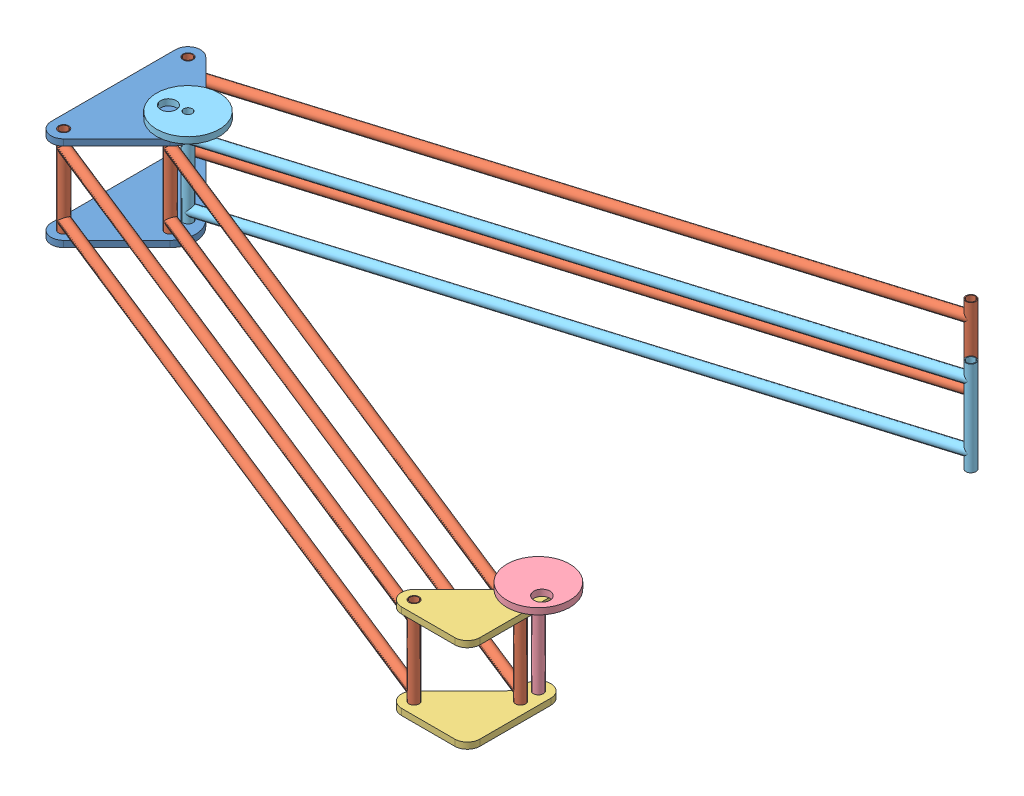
SolidWorks assembly Frame.SLDASM, configuration Default (file format 15000). Lengths in mm.
Overall size (1103.53 160 888.78).
9 component instances, 5 part files, 23 mates.
Components (placement in the parent):
- Joint 2-1: Joint 2.SLDPRT [Default] at (-54.3755 63.423 408.9315) size (130.71 10 237.99)
- Joint 2-2: Joint 2.SLDPRT [Default] at (-54.3755 -76.577 408.9315) size (130.71 10 237.99)
- trus-1: trus.SLDPRT [Default] at (894.4006 -1.577 731.2887) x (-0.928776 0 -0.370641) z (0 1 0) size (1016 16 150)
- trus-2: trus.SLDPRT [Default] at (922.5982 -1.577 -127.5176) x (-0.956974 0 0.290175) z (0 1 0) size (1016 16 150)
- trus-3: trus.SLDPRT [Default] at (979.2534 -1.577 646.4358) x (-0.928776 0 -0.370641) z (0 1 0) size (1016 16 150)
- Joint 1-1: Joint 1.SLDPRT [Default] at (846.1163 -76.577 751.2887) x (1 0 0) z (0 1 0) size (124.85 153.13 10)
- Joint 1-2: Joint 1.SLDPRT [Default] at (846.1163 63.423 751.2887) x (1 0 0) z (0 1 0) size (124.85 153.13 10)
- aandrijfas J1-2: aandrijfas J1.SLDPRT [Default] at (979.2534 83.423 618.1558) x (0.805692 0 0.592334) z (0.592334 0 -0.805692) size (100 160 100)
- trus aandrijf-1: trus aandrijf.SLDPRT [Default] at (1007.451 -1.577 -42.6648) x (-0.956974 0 0.290175) z (0 -1 0) size (1058 100 160)
Mates (geometry in assembly coordinates):
- Concentric1: concentric anti-aligned: cylinder of Joint 2-2 through (50.4773 -66.577 275.7944) axis (0 -1 0) radius 8; cylinder of trus-3 through (50.4773 -76.577 275.7944) axis (0 1 0) radius 6.75
- Concentric2: concentric anti-aligned: cylinder of Joint 2-2 through (-34.3755 -66.577 360.6472) axis (0 -1 0) radius 8; cylinder of trus-1 through (-34.3755 -76.577 360.6472) axis (0 1 0) radius 8
- Concentric4: concentric anti-aligned: cylinder of Joint 2-2 through (-34.3755 -66.577 162.6573) axis (0 -1 0) radius 8; cylinder of trus-2 through (-34.3755 -76.577 162.6573) axis (0 1 0) radius 8
- Coincident1: coincident aligned: plane of Joint 2-2 through (36.3352 -76.577 261.6523) normal (0 -1 0); plane of trus-2 through (-34.3755 -76.577 162.6573) normal (0 -1 0)
- Coincident2: coincident aligned: plane of Joint 2-2 through (36.3352 -76.577 261.6523) normal (0 -1 0); plane of trus-1 through (-34.3755 -76.577 360.6472) normal (0 -1 0)
- Coincident4: coincident anti-aligned: plane of Joint 2-2 through (36.3352 -76.577 261.6523) normal (0 -1 0); circle of trus-3
- Coincident5: coincident aligned: plane of Joint 2-1 through (36.3352 73.423 261.6523) normal (0 1 0); plane of trus-1 through (-34.3755 73.423 360.6472) normal (0 1 0)
- Concentric5: concentric anti-aligned: cylinder of Joint 2-1 through (50.4773 73.423 275.7944) axis (0 -1 0) radius 8; cylinder of trus-3 through (50.4773 -76.577 275.7944) axis (0 1 0) radius 8
- Concentric6: concentric anti-aligned: cylinder of Joint 2-1 through (-34.3755 73.423 360.6472) axis (0 -1 0) radius 8; cylinder of trus-1 through (-34.3755 -76.577 360.6472) axis (0 1 0) radius 8
- Parallel1: parallel aligned: cylinder of trus-1 through (-34.3755 48.423 360.6472) axis (0.928776 0 0.370641) radius 8; cylinder of trus-3 through (50.4773 48.423 275.7944) axis (0.928776 0 0.370641) radius 8
- Concentric9: concentric anti-aligned: cylinder of trus-1 through (894.4006 -76.577 731.2887) axis (0 1 0) radius 8; cylinder of Joint 1-1 through (894.4006 -66.577 731.2887) axis (0 -1 0) radius 8
- Parallel3: parallel anti-aligned: cylinder of trus-3 through (979.2534 -76.577 646.4358) axis (0 1 0) radius 8; cylinder of Joint 1-1 through (979.2534 -66.577 646.4358) axis (0 -1 0) radius 8
- Concentric11: concentric anti-aligned: cylinder of trus-3 through (979.2534 -76.577 646.4358) axis (0 1 0) radius 8; cylinder of Joint 1-1 through (979.2534 -66.577 646.4358) axis (0 -1 0) radius 8
- Coincident8: coincident aligned: plane of trus-3 through (979.2534 -76.577 646.4358) normal (0 -1 0); plane of Joint 1-1 through (979.2534 -76.577 618.1558) normal (0 -1 0)
- Concentric12: concentric anti-aligned: cylinder of trus-1 through (894.4006 -76.577 731.2887) axis (0 1 0) radius 8; cylinder of Joint 1-2 through (894.4006 73.423 731.2887) axis (0 -1 0) radius 8
- Coincident9: coincident aligned: plane of trus-3 through (979.2534 73.423 646.4358) normal (0 1 0); plane of Joint 1-2 through (979.2534 73.423 618.1558) normal (0 1 0)
- Concentric13: concentric anti-aligned: cylinder of trus-3 through (979.2534 -76.577 646.4358) axis (0 1 0) radius 8; cylinder of Joint 1-2 through (979.2534 73.423 646.4358) axis (0 -1 0) radius 8
- Concentric15: concentric anti-aligned: cylinder of Joint 1-1 through (979.2534 -66.577 618.1558) axis (0 -1 0) radius 8; cylinder of aandrijfas J1-2 through (979.2534 -76.577 618.1558) axis (0 1 0) radius 8
- Coincident11: coincident anti-aligned: plane of aandrijfas J1-2 through (979.2534 73.423 618.1558) normal (0 -1 0); plane of Joint 1-2 through (979.2534 73.423 618.1558) normal (0 1 0)
- Concentric16: concentric aligned: cylinder of Joint 2-1 through (50.4773 73.423 247.5101) axis (0 -1 0) radius 8; cylinder of trus aandrijf-1 through (50.4773 73.423 247.5101) axis (0 -1 0) radius 8
- Coincident12: coincident aligned: plane of Joint 2-2 through (36.3352 -76.577 261.6523) normal (0 -1 0); plane of trus aandrijf-1 through (50.4773 -76.577 247.5101) normal (0 -1 0)
- Parallel4: parallel aligned: cylinder of trus-2 through (-34.3755 48.423 162.6573) axis (0.956974 0 -0.290175) radius 8; cylinder of trus aandrijf-1 through (50.4773 48.423 247.5101) axis (0.956974 0 -0.290175) radius 8
- BeltMate1: belt = 100 mm: cylinder of trus aandrijf-1 through (50.4773 83.423 247.5101) axis (0 -1 0) radius 50; cylinder of aandrijfas J1-2 through (979.2534 73.423 618.1558) axis (0 1 0) radius 50
